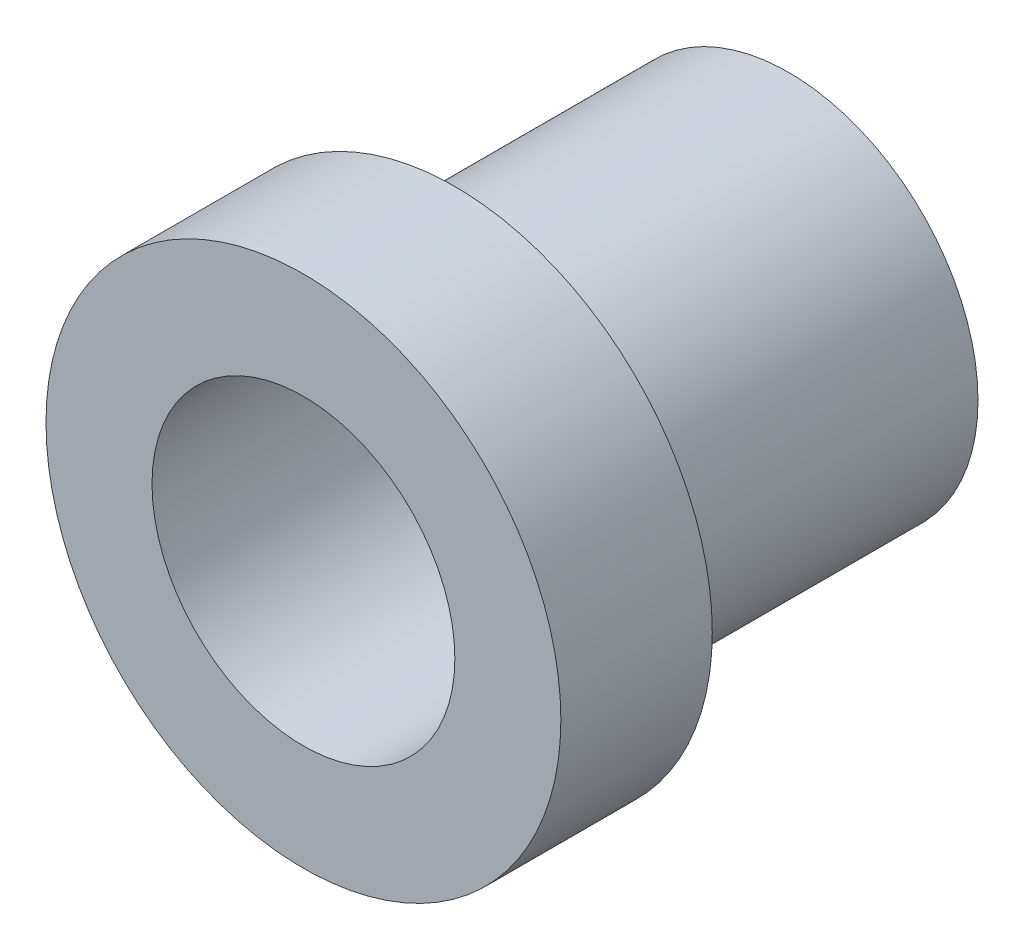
from build123d import *
from build123d.topology import SkipClean

# Parameters (mm, degrees)
SKETCH1_R           = 5.3975
SKETCH1_R_2         = 3.175
BOSS_EXTRUDE1_DEPTH = 3.175
BOSS_EXTRUDE2_START = 7
SKETCH2_R           = 3.96875
SKETCH2_R_2         = 3.175
BOSS_EXTRUDE2_DEPTH = 7


with BuildPart() as part:
    # Sketch1 → Boss-Extrude1 (new body)
    with BuildSketch(Plane.XY):
        Circle(SKETCH1_R)
        Circle(SKETCH1_R_2, mode=Mode.SUBTRACT)
    extrude(amount=BOSS_EXTRUDE1_DEPTH)

    # Sketch2 → Boss-Extrude2 (add)
    with SkipClean():  # the faces are left unmerged after this step: merging them gives an invalid solid
        with BuildSketch(Plane(origin=(0, 0, 0), x_dir=(-1, 0, 0), z_dir=(0, 0, -1)).offset(BOSS_EXTRUDE2_START)):
            with Locations(Location((0, 0, 0), (0, 0, 180))):
                Circle(SKETCH2_R)
            Circle(SKETCH2_R_2, mode=Mode.SUBTRACT)
        extrude(amount=-BOSS_EXTRUDE2_DEPTH)


solid = part.part
